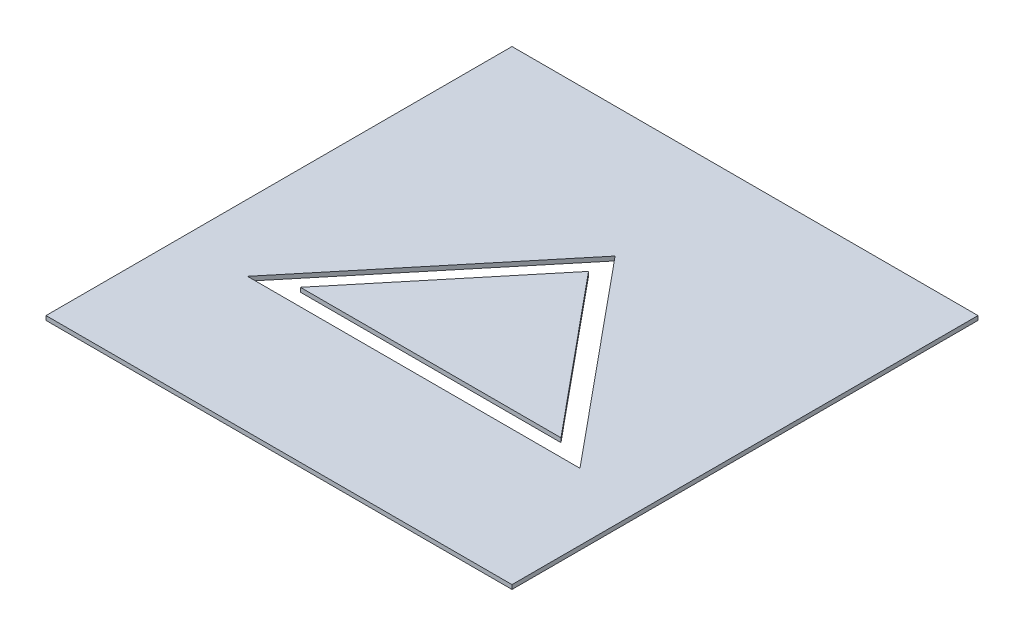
from build123d import *

# Parameters (mm, degrees)
SKETCH1_W             = 279.4
SKETCH1_H             = 279.4
BOSS_EXTRUDE1_DEPTH   = 2.54
BOSS_EXTRUDE1_2_DEPTH = 2.54


with BuildPart() as part:
    # Sketch1 → Boss-Extrude1 (new body)
    with BuildSketch(Plane(origin=(0, 0, 0), x_dir=(1, 0, 0), z_dir=(0, 1, 0))):
        with Locations((-139.7, 139.7)):
            Rectangle(SKETCH1_W, SKETCH1_H)
        Polygon((-40.019106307, 80.772), (-239.380893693, 80.772), (-139.7, 201.522739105), align=None, mode=Mode.SUBTRACT)
    extrude(amount=BOSS_EXTRUDE1_DEPTH)


with BuildPart() as body_2:
    # Sketch1 → Boss-Extrude1 2 (new body)
    with BuildSketch(Plane(origin=(0, 0, 0), x_dir=(1, 0, 0), z_dir=(0, 1, 0))):
        Polygon((-217.819106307, 90.932), (-61.580893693, 90.932), (-139.7, 185.563372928), align=None)
    extrude(amount=BOSS_EXTRUDE1_2_DEPTH)


solid = Compound([part.part, body_2.part])
